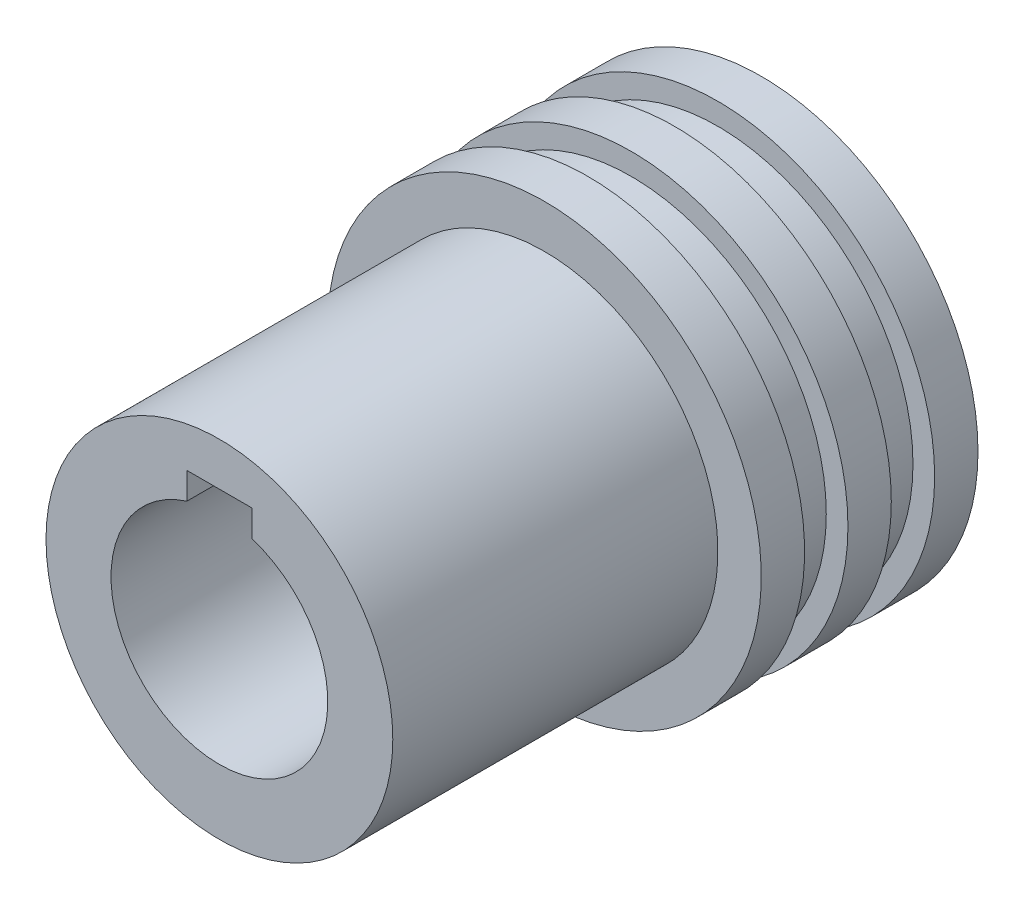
from build123d import *

# Parameters (mm, degrees)
ESQUISSE1_R             = 8
BOSS_EXTRU_1_DEPTH      = 15
ESQUISSE2_R             = 10
BOSS_EXTRU_2_DEPTH      = 10
ESQUISSE3_W             = 2
ESQUISSE3_H             = 1.725995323
ENL_V_MAT_EXTRU_1_DEPTH = 26


with BuildPart() as part:
    # Esquisse1 → Boss.-Extru.1 (new body)
    with BuildSketch(Plane.XY):
        Circle(ESQUISSE1_R)
    extrude(amount=BOSS_EXTRU_1_DEPTH)

    # Esquisse2 → Boss.-Extru.2 (add)
    with BuildSketch(Plane(origin=(0, 0, 0), x_dir=(-1, 0, 0), z_dir=(0, 0, -1))):
        Circle(ESQUISSE2_R)
    extrude(amount=BOSS_EXTRU_2_DEPTH)

    # Esquisse3 → Enl_vement de mati_re-R_volution1 (revolve, cut)
    with BuildSketch(Plane(origin=(0, 0, 0), x_dir=(0, 0, -1), z_dir=(1, 0, 0)), mode=Mode.PRIVATE) as enl_vement_de_mati_re_r_volution1_sk:
        with Locations((3, 9.862997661)):
            Rectangle(ESQUISSE3_W, ESQUISSE3_H)
        with Locations((7, 9.862997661)):
            Rectangle(ESQUISSE3_W, ESQUISSE3_H)
    revolve(enl_vement_de_mati_re_r_volution1_sk.sketch.rotate(Axis((0, 0, 0), (0, 0, -1)), 90), axis=Axis((0, 0, 0), (0, 0, -1)), mode=Mode.SUBTRACT)

    # Esquisse4 → Enl_v. mat.-Extru.1 (cut)
    with BuildSketch(Plane.XY.offset(15)):
        with BuildLine():
            Line((-1.5, 6), (1.5, 6))
            Line((1.5, 6), (1.5, 4.769696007))
            ThreePointArc((1.5, 4.769696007), (0, -5), (-1.5, 4.769696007))
            Line((-1.5, 4.769696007), (-1.5, 6))
        make_face()
    extrude(amount=-ENL_V_MAT_EXTRU_1_DEPTH, mode=Mode.SUBTRACT)


solid = part.part
